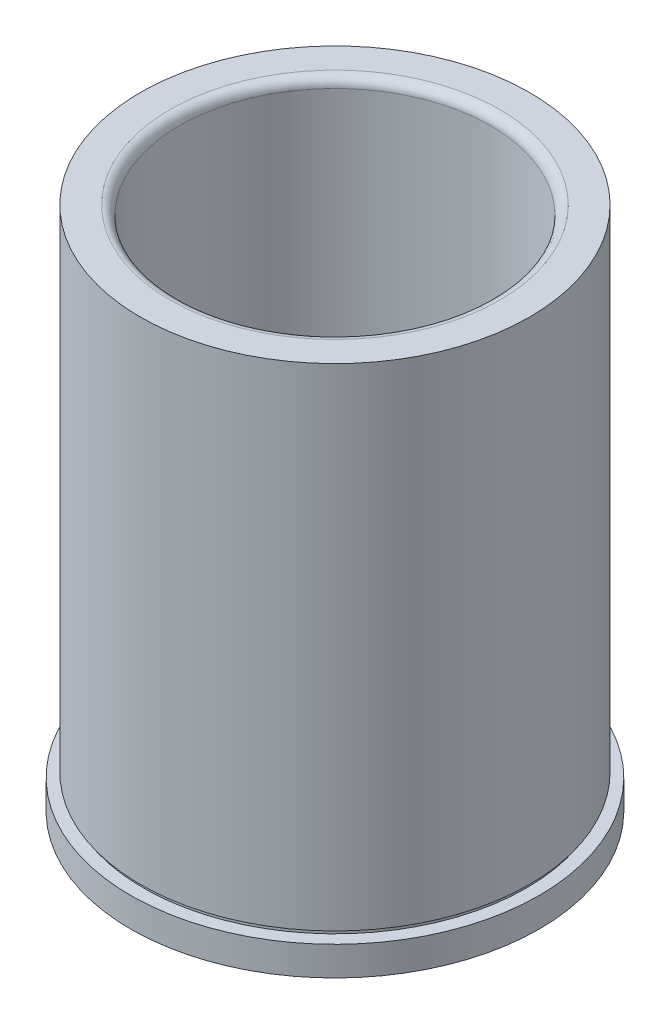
from build123d import *

# Parameters (mm, degrees)
FILLET1_R = 1.524


with BuildPart() as part:
    # Sketch1 → Revolve1 (revolve)
    with BuildSketch(Plane.XY, mode=Mode.PRIVATE) as revolve1_sk:
        Polygon((-25.40635, 101.650690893), (-25.40635, 16.741746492), (-26.222405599, 15.925690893), (-33.3375, 15.925690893), (-33.3375, 20.688190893), (-31.24835, 20.688190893), (-31.24835, 21.450190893), (-31.75635, 21.450190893), (-31.75635, 101.650690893), align=None)
    revolve(revolve1_sk.sketch.rotate(Axis((0, -1000, 0), (0, 1, 0)), 180), axis=Axis((0, -1000, 0), (0, 1, 0)))

    # Fillet1
    fillet1_edges = [part.edges().sort_by_distance(p)[0] for p in [
        (-25.40635, 101.650690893, 0),
    ]]
    fillet(fillet1_edges, radius=FILLET1_R)


solid = part.part
